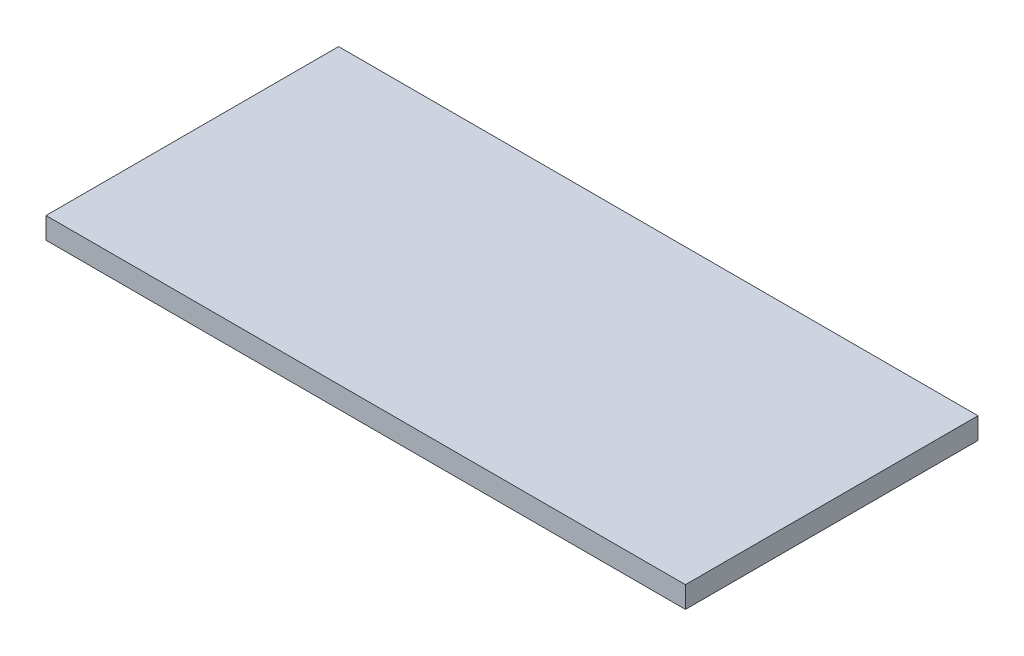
from build123d import *

# Parameters (mm, degrees)
ESQUISSE1_W        = 304
ESQUISSE1_H        = 139.1
BOSS_EXTRU_1_DEPTH = 5.1


with BuildPart() as part:
    # Esquisse1 → Boss.-Extru.1 (new, symmetric)
    with BuildSketch(Plane(origin=(0, 0, 0), x_dir=(1, 0, 0), z_dir=(0, 1, 0))):
        Rectangle(ESQUISSE1_W, ESQUISSE1_H)
    extrude(amount=BOSS_EXTRU_1_DEPTH, both=True)


solid = part.part
